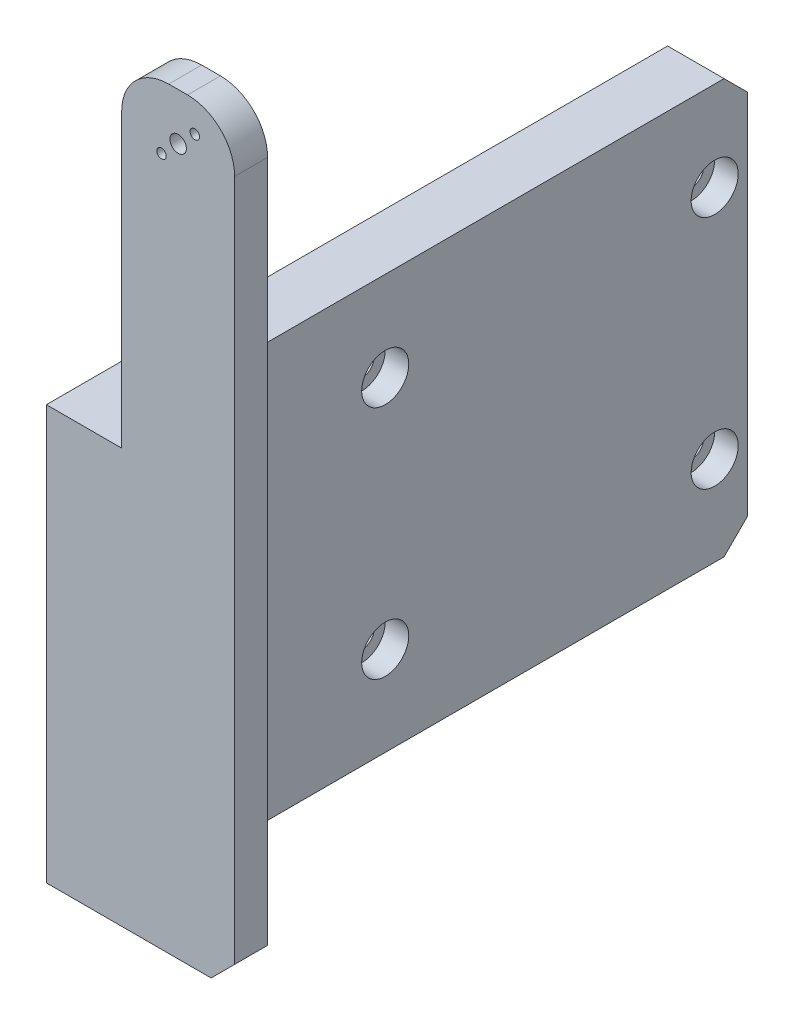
ISO-10303-21;
HEADER;
FILE_DESCRIPTION(('STEP AP214'),'2;1');
FILE_NAME('part.step','',(''),(''),'','','');
FILE_SCHEMA(('AUTOMOTIVE_DESIGN { 1 0 10303 214 1 1 1 1 }'));
ENDSEC;
DATA;
#1=APPLICATION_CONTEXT('core data for automotive mechanical design processes');
#2=APPLICATION_PROTOCOL_DEFINITION('international standard','automotive_design',2000,#1);
#3=PRODUCT_CONTEXT('',#1,'mechanical');
#4=PRODUCT('Part','Part','',(#3));
#5=PRODUCT_RELATED_PRODUCT_CATEGORY('part','',(#4));
#6=PRODUCT_DEFINITION_FORMATION('','',#4);
#7=PRODUCT_DEFINITION_CONTEXT('part definition',#1,'design');
#8=PRODUCT_DEFINITION('design','',#6,#7);
#9=PRODUCT_DEFINITION_SHAPE('','',#8);
#10=(LENGTH_UNIT() NAMED_UNIT(*) SI_UNIT(.MILLI.,.METRE.));
#11=(NAMED_UNIT(*) PLANE_ANGLE_UNIT() SI_UNIT($,.RADIAN.));
#12=(NAMED_UNIT(*) SI_UNIT($,.STERADIAN.) SOLID_ANGLE_UNIT());
#13=UNCERTAINTY_MEASURE_WITH_UNIT(LENGTH_MEASURE(1.E-05),#10,'distance_accuracy_value','');
#14=(GEOMETRIC_REPRESENTATION_CONTEXT(3) GLOBAL_UNCERTAINTY_ASSIGNED_CONTEXT((#13)) GLOBAL_UNIT_ASSIGNED_CONTEXT((#10,
#11,#12)) REPRESENTATION_CONTEXT('',''));
#15=CARTESIAN_POINT('',(0.,0.,0.));
#16=DIRECTION('',(0.,0.,1.));
#17=DIRECTION('',(1.,0.,0.));
#18=AXIS2_PLACEMENT_3D('',#15,#16,#17);
#19=CARTESIAN_POINT('',(2230.37555921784,777.962852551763,7.));
#20=DIRECTION('',(1.,0.,0.));
#21=DIRECTION('',(0.,1.,0.));
#22=AXIS2_PLACEMENT_3D('',#19,#20,#21);
#23=PLANE('',#22);
#24=DIRECTION('',(0.,-1.,0.));
#25=VECTOR('',#24,1.);
#26=CARTESIAN_POINT('',(2230.37555921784,777.962852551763,0.));
#27=LINE('',#26,#25);
#28=CARTESIAN_POINT('',(2230.37555921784,767.962852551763,0.));
#29=VERTEX_POINT('',#28);
#30=CARTESIAN_POINT('',(2230.37555921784,705.962852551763,0.));
#31=VERTEX_POINT('',#30);
#32=EDGE_CURVE('E141',#29,#31,#27,.T.);
#33=ORIENTED_EDGE('',*,*,#32,.T.);
#34=DIRECTION('',(0.,0.,-1.));
#35=VECTOR('',#34,1.);
#36=CARTESIAN_POINT('',(2230.37555921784,705.962852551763,7.));
#37=LINE('',#36,#35);
#38=CARTESIAN_POINT('',(2230.37555921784,705.962852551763,7.));
#39=VERTEX_POINT('',#38);
#40=EDGE_CURVE('E153',#39,#31,#37,.T.);
#41=ORIENTED_EDGE('',*,*,#40,.F.);
#42=DIRECTION('',(0.,-1.,0.));
#43=VECTOR('',#42,1.);
#44=CARTESIAN_POINT('',(2230.37555921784,777.962852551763,7.));
#45=LINE('',#44,#43);
#46=CARTESIAN_POINT('',(2230.37555921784,767.962852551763,7.));
#47=VERTEX_POINT('',#46);
#48=EDGE_CURVE('E176',#47,#39,#45,.T.);
#49=ORIENTED_EDGE('',*,*,#48,.F.);
#50=DIRECTION('',(0.,0.,-1.));
#51=VECTOR('',#50,1.);
#52=CARTESIAN_POINT('',(2230.37555921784,767.962852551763,7.));
#53=LINE('',#52,#51);
#54=EDGE_CURVE('E155',#47,#29,#53,.T.);
#55=ORIENTED_EDGE('',*,*,#54,.T.);
#56=EDGE_LOOP('',(#33,#41,#49,#55));
#57=FACE_BOUND('',#56,.T.);
#58=ADVANCED_FACE('F34',(#57),#23,.F.);
#59=CARTESIAN_POINT('',(2232.37555921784,617.962852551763,-6.00000000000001));
#60=DIRECTION('',(0.,1.,0.));
#61=DIRECTION('',(0.,0.,1.));
#62=AXIS2_PLACEMENT_3D('',#59,#60,#61);
#63=CYLINDRICAL_SURFACE('',#62,6.);
#64=CARTESIAN_POINT('',(2232.37555921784,705.962852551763,-6.00000000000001));
#65=DIRECTION('',(0.,-1.,0.));
#66=DIRECTION('',(1.,0.,0.));
#67=AXIS2_PLACEMENT_3D('',#64,#65,#66);
#68=CIRCLE('',#67,6.);
#69=CARTESIAN_POINT('',(2232.37555921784,705.962852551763,6.66133814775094E-13));
#70=VERTEX_POINT('',#69);
#71=CARTESIAN_POINT('',(2226.37555921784,705.962852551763,-6.00000000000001));
#72=VERTEX_POINT('',#71);
#73=EDGE_CURVE('E198',#70,#72,#68,.T.);
#74=ORIENTED_EDGE('',*,*,#73,.F.);
#75=DIRECTION('',(0.,-1.,0.));
#76=VECTOR('',#75,1.);
#77=CARTESIAN_POINT('',(2232.37555921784,705.962852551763,0.));
#78=LINE('',#77,#76);
#79=CARTESIAN_POINT('',(2232.37555921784,617.962852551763,0.));
#80=VERTEX_POINT('',#79);
#81=EDGE_CURVE('E145',#80,#70,#78,.F.);
#82=ORIENTED_EDGE('',*,*,#81,.F.);
#83=CARTESIAN_POINT('',(2232.37555921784,617.962852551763,-6.00000000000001));
#84=DIRECTION('',(0.,1.,0.));
#85=DIRECTION('',(0.,0.,1.));
#86=AXIS2_PLACEMENT_3D('',#83,#84,#85);
#87=CIRCLE('',#86,6.);
#88=CARTESIAN_POINT('',(2226.37555921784,617.962852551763,-6.00000000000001));
#89=VERTEX_POINT('',#88);
#90=EDGE_CURVE('E196',#89,#80,#87,.T.);
#91=ORIENTED_EDGE('',*,*,#90,.F.);
#92=DIRECTION('',(0.,-1.,0.));
#93=VECTOR('',#92,1.);
#94=CARTESIAN_POINT('',(2226.37555921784,617.962852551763,-6.00000000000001));
#95=LINE('',#94,#93);
#96=EDGE_CURVE('E186',#72,#89,#95,.T.);
#97=ORIENTED_EDGE('',*,*,#96,.F.);
#98=EDGE_LOOP('',(#74,#82,#91,#97));
#99=FACE_BOUND('',#98,.T.);
#100=ADVANCED_FACE('F343',(#99),#63,.F.);
#101=CARTESIAN_POINT('',(2240.37555921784,767.962852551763,7.));
#102=DIRECTION('',(0.,0.,-1.));
#103=DIRECTION('',(-1.,0.,0.));
#104=AXIS2_PLACEMENT_3D('',#101,#102,#103);
#105=CYLINDRICAL_SURFACE('',#104,10.);
#106=CARTESIAN_POINT('',(2240.37555921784,767.962852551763,0.));
#107=DIRECTION('',(0.,0.,1.));
#108=DIRECTION('',(1.,0.,0.));
#109=AXIS2_PLACEMENT_3D('',#106,#107,#108);
#110=CIRCLE('',#109,10.);
#111=CARTESIAN_POINT('',(2240.37555921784,777.962852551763,0.));
#112=VERTEX_POINT('',#111);
#113=EDGE_CURVE('E51',#29,#112,#110,.F.);
#114=ORIENTED_EDGE('',*,*,#113,.F.);
#115=ORIENTED_EDGE('',*,*,#54,.F.);
#116=CARTESIAN_POINT('',(2240.37555921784,767.962852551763,7.));
#117=DIRECTION('',(0.,0.,1.));
#118=DIRECTION('',(1.,0.,0.));
#119=AXIS2_PLACEMENT_3D('',#116,#117,#118);
#120=CIRCLE('',#119,10.);
#121=CARTESIAN_POINT('',(2240.37555921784,777.962852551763,7.));
#122=VERTEX_POINT('',#121);
#123=EDGE_CURVE('E224',#122,#47,#120,.T.);
#124=ORIENTED_EDGE('',*,*,#123,.F.);
#125=DIRECTION('',(0.,0.,-1.));
#126=VECTOR('',#125,1.);
#127=CARTESIAN_POINT('',(2240.37555921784,777.962852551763,7.));
#128=LINE('',#127,#126);
#129=EDGE_CURVE('E212',#112,#122,#128,.F.);
#130=ORIENTED_EDGE('',*,*,#129,.F.);
#131=EDGE_LOOP('',(#114,#115,#124,#130));
#132=FACE_BOUND('',#131,.T.);
#133=ADVANCED_FACE('F316',(#132),#105,.T.);
#134=CARTESIAN_POINT('',(2214.37555921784,636.962852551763,-123.));
#135=DIRECTION('',(1.,0.,0.));
#136=DIRECTION('',(0.,0.,-1.));
#137=AXIS2_PLACEMENT_3D('',#134,#135,#136);
#138=CYLINDRICAL_SURFACE('',#137,2.65);
#139=CARTESIAN_POINT('',(2214.37555921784,636.962852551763,-123.));
#140=DIRECTION('',(1.,0.,0.));
#141=DIRECTION('',(0.,0.,-1.));
#142=AXIS2_PLACEMENT_3D('',#139,#140,#141);
#143=CIRCLE('',#142,2.65);
#144=CARTESIAN_POINT('',(2214.37555921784,636.962852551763,-125.65));
#145=VERTEX_POINT('',#144);
#146=EDGE_CURVE('E280',#145,#145,#143,.T.);
#147=ORIENTED_EDGE('',*,*,#146,.F.);
#148=EDGE_LOOP('',(#147));
#149=FACE_BOUND('',#148,.T.);
#150=CARTESIAN_POINT('',(2221.37555921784,636.962852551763,-123.));
#151=DIRECTION('',(1.,0.,0.));
#152=DIRECTION('',(0.,0.,-1.));
#153=AXIS2_PLACEMENT_3D('',#150,#151,#152);
#154=CIRCLE('',#153,2.65);
#155=CARTESIAN_POINT('',(2221.37555921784,636.962852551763,-125.65));
#156=VERTEX_POINT('',#155);
#157=EDGE_CURVE('E38',#156,#156,#154,.F.);
#158=ORIENTED_EDGE('',*,*,#157,.F.);
#159=EDGE_LOOP('',(#158));
#160=FACE_BOUND('',#159,.T.);
#161=ADVANCED_FACE('F366',(#149,#160),#138,.F.);
#162=CARTESIAN_POINT('',(2214.37555921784,686.962852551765,-53.));
#163=DIRECTION('',(1.,0.,0.));
#164=DIRECTION('',(0.,0.,-1.));
#165=AXIS2_PLACEMENT_3D('',#162,#163,#164);
#166=CYLINDRICAL_SURFACE('',#165,2.65);
#167=CARTESIAN_POINT('',(2214.37555921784,686.962852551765,-53.));
#168=DIRECTION('',(1.,0.,0.));
#169=DIRECTION('',(0.,0.,-1.));
#170=AXIS2_PLACEMENT_3D('',#167,#168,#169);
#171=CIRCLE('',#170,2.65);
#172=CARTESIAN_POINT('',(2214.37555921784,686.962852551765,-55.65));
#173=VERTEX_POINT('',#172);
#174=EDGE_CURVE('E264',#173,#173,#171,.T.);
#175=ORIENTED_EDGE('',*,*,#174,.F.);
#176=EDGE_LOOP('',(#175));
#177=FACE_BOUND('',#176,.T.);
#178=CARTESIAN_POINT('',(2221.37555921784,686.962852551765,-53.));
#179=DIRECTION('',(1.,0.,0.));
#180=DIRECTION('',(0.,0.,-1.));
#181=AXIS2_PLACEMENT_3D('',#178,#179,#180);
#182=CIRCLE('',#181,2.65);
#183=CARTESIAN_POINT('',(2221.37555921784,686.962852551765,-55.65));
#184=VERTEX_POINT('',#183);
#185=EDGE_CURVE('E259',#184,#184,#182,.F.);
#186=ORIENTED_EDGE('',*,*,#185,.F.);
#187=EDGE_LOOP('',(#186));
#188=FACE_BOUND('',#187,.T.);
#189=ADVANCED_FACE('F435',(#177,#188),#166,.F.);
#190=CARTESIAN_POINT('',(2214.37555921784,636.962852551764,-52.9999999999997));
#191=DIRECTION('',(1.,0.,0.));
#192=DIRECTION('',(0.,0.,-1.));
#193=AXIS2_PLACEMENT_3D('',#190,#191,#192);
#194=CYLINDRICAL_SURFACE('',#193,2.65);
#195=CARTESIAN_POINT('',(2214.37555921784,636.962852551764,-52.9999999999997));
#196=DIRECTION('',(1.,0.,0.));
#197=DIRECTION('',(0.,0.,-1.));
#198=AXIS2_PLACEMENT_3D('',#195,#196,#197);
#199=CIRCLE('',#198,2.65);
#200=CARTESIAN_POINT('',(2214.37555921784,636.962852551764,-55.6499999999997));
#201=VERTEX_POINT('',#200);
#202=EDGE_CURVE('E268',#201,#201,#199,.T.);
#203=ORIENTED_EDGE('',*,*,#202,.F.);
#204=EDGE_LOOP('',(#203));
#205=FACE_BOUND('',#204,.T.);
#206=CARTESIAN_POINT('',(2221.37555921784,636.962852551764,-52.9999999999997));
#207=DIRECTION('',(1.,0.,0.));
#208=DIRECTION('',(0.,0.,-1.));
#209=AXIS2_PLACEMENT_3D('',#206,#207,#208);
#210=CIRCLE('',#209,2.65);
#211=CARTESIAN_POINT('',(2221.37555921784,636.962852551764,-55.6499999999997));
#212=VERTEX_POINT('',#211);
#213=EDGE_CURVE('E256',#212,#212,#210,.F.);
#214=ORIENTED_EDGE('',*,*,#213,.F.);
#215=EDGE_LOOP('',(#214));
#216=FACE_BOUND('',#215,.T.);
#217=ADVANCED_FACE('F427',(#205,#216),#194,.F.);
#218=CARTESIAN_POINT('',(2214.37555921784,686.962852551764,-123.));
#219=DIRECTION('',(1.,0.,0.));
#220=DIRECTION('',(0.,0.,-1.));
#221=AXIS2_PLACEMENT_3D('',#218,#219,#220);
#222=CYLINDRICAL_SURFACE('',#221,2.65000000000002);
#223=CARTESIAN_POINT('',(2214.37555921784,686.962852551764,-123.));
#224=DIRECTION('',(1.,0.,0.));
#225=DIRECTION('',(0.,0.,-1.));
#226=AXIS2_PLACEMENT_3D('',#223,#224,#225);
#227=CIRCLE('',#226,2.65000000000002);
#228=CARTESIAN_POINT('',(2214.37555921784,686.962852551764,-125.65));
#229=VERTEX_POINT('',#228);
#230=EDGE_CURVE('E273',#229,#229,#227,.T.);
#231=ORIENTED_EDGE('',*,*,#230,.F.);
#232=EDGE_LOOP('',(#231));
#233=FACE_BOUND('',#232,.T.);
#234=CARTESIAN_POINT('',(2221.37555921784,686.962852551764,-123.));
#235=DIRECTION('',(1.,0.,0.));
#236=DIRECTION('',(0.,0.,-1.));
#237=AXIS2_PLACEMENT_3D('',#234,#235,#236);
#238=CIRCLE('',#237,2.65000000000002);
#239=CARTESIAN_POINT('',(2221.37555921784,686.962852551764,-125.65));
#240=VERTEX_POINT('',#239);
#241=EDGE_CURVE('E253',#240,#240,#238,.F.);
#242=ORIENTED_EDGE('',*,*,#241,.F.);
#243=EDGE_LOOP('',(#242));
#244=FACE_BOUND('',#243,.T.);
#245=ADVANCED_FACE('F405',(#233,#244),#222,.F.);
#246=CARTESIAN_POINT('',(0.,0.,0.));
#247=DIRECTION('',(0.,0.,1.));
#248=DIRECTION('',(1.,0.,0.));
#249=AXIS2_PLACEMENT_3D('',#246,#247,#248);
#250=PLANE('',#249);
#251=CARTESIAN_POINT('',(2238.83720462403,764.424765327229,0.));
#252=DIRECTION('',(0.,0.,1.));
#253=DIRECTION('',(1.,0.,0.));
#254=AXIS2_PLACEMENT_3D('',#251,#252,#253);
#255=CIRCLE('',#254,1.5045700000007);
#256=CARTESIAN_POINT('',(2240.34177462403,764.424765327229,0.));
#257=VERTEX_POINT('',#256);
#258=EDGE_CURVE('E203',#257,#257,#255,.T.);
#259=ORIENTED_EDGE('',*,*,#258,.T.);
#260=EDGE_LOOP('',(#259));
#261=FACE_BOUND('',#260,.T.);
#262=CARTESIAN_POINT('',(2245.91391381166,771.500939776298,0.));
#263=DIRECTION('',(0.,0.,1.));
#264=DIRECTION('',(1.,0.,0.));
#265=AXIS2_PLACEMENT_3D('',#262,#263,#264);
#266=CIRCLE('',#265,1.50456999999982);
#267=CARTESIAN_POINT('',(2247.41848381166,771.500939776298,0.));
#268=VERTEX_POINT('',#267);
#269=EDGE_CURVE('E200',#268,#268,#266,.T.);
#270=ORIENTED_EDGE('',*,*,#269,.T.);
#271=EDGE_LOOP('',(#270));
#272=FACE_BOUND('',#271,.T.);
#273=CARTESIAN_POINT('',(2242.37555921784,767.962852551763,0.));
#274=DIRECTION('',(0.,0.,1.));
#275=DIRECTION('',(1.,0.,0.));
#276=AXIS2_PLACEMENT_3D('',#273,#274,#275);
#277=CIRCLE('',#276,1.75000000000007);
#278=CARTESIAN_POINT('',(2244.12555921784,767.962852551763,0.));
#279=VERTEX_POINT('',#278);
#280=EDGE_CURVE('E293',#279,#279,#277,.T.);
#281=ORIENTED_EDGE('',*,*,#280,.T.);
#282=EDGE_LOOP('',(#281));
#283=FACE_BOUND('',#282,.T.);
#284=DIRECTION('',(0.,1.,0.));
#285=VECTOR('',#284,1.);
#286=CARTESIAN_POINT('',(2254.37555921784,777.962852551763,0.));
#287=LINE('',#286,#285);
#288=CARTESIAN_POINT('',(2254.37555921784,622.962852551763,0.));
#289=VERTEX_POINT('',#288);
#290=CARTESIAN_POINT('',(2254.37555921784,767.962852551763,0.));
#291=VERTEX_POINT('',#290);
#292=EDGE_CURVE('E189',#289,#291,#287,.T.);
#293=ORIENTED_EDGE('',*,*,#292,.F.);
#294=DIRECTION('',(0.707106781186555,0.70710678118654,0.));
#295=VECTOR('',#294,1.);
#296=CARTESIAN_POINT('',(2254.37555921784,622.962852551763,0.));
#297=LINE('',#296,#295);
#298=CARTESIAN_POINT('',(2249.37555921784,617.962852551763,0.));
#299=VERTEX_POINT('',#298);
#300=EDGE_CURVE('E43',#289,#299,#297,.F.);
#301=ORIENTED_EDGE('',*,*,#300,.T.);
#302=DIRECTION('',(1.,0.,0.));
#303=VECTOR('',#302,1.);
#304=CARTESIAN_POINT('',(2230.37555921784,617.962852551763,0.));
#305=LINE('',#304,#303);
#306=EDGE_CURVE('E175',#80,#299,#305,.T.);
#307=ORIENTED_EDGE('',*,*,#306,.F.);
#308=ORIENTED_EDGE('',*,*,#81,.T.);
#309=DIRECTION('',(1.,0.,3.32944442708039E-13));
#310=VECTOR('',#309,1.);
#311=CARTESIAN_POINT('',(2232.37555921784,705.962852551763,6.66133814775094E-13));
#312=LINE('',#311,#310);
#313=EDGE_CURVE('E137',#31,#70,#312,.T.);
#314=ORIENTED_EDGE('',*,*,#313,.F.);
#315=ORIENTED_EDGE('',*,*,#32,.F.);
#316=ORIENTED_EDGE('',*,*,#113,.T.);
#317=DIRECTION('',(-1.,0.,0.));
#318=VECTOR('',#317,1.);
#319=CARTESIAN_POINT('',(2230.37555921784,777.962852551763,0.));
#320=LINE('',#319,#318);
#321=CARTESIAN_POINT('',(2244.37555921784,777.962852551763,0.));
#322=VERTEX_POINT('',#321);
#323=EDGE_CURVE('E179',#322,#112,#320,.T.);
#324=ORIENTED_EDGE('',*,*,#323,.F.);
#325=CARTESIAN_POINT('',(2244.37555921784,767.962852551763,0.));
#326=DIRECTION('',(0.,0.,1.));
#327=DIRECTION('',(1.,0.,0.));
#328=AXIS2_PLACEMENT_3D('',#325,#326,#327);
#329=CIRCLE('',#328,10.);
#330=EDGE_CURVE('E218',#322,#291,#329,.F.);
#331=ORIENTED_EDGE('',*,*,#330,.T.);
#332=EDGE_LOOP('',(#293,#301,#307,#308,#314,#315,#316,#324,#331));
#333=FACE_BOUND('',#332,.T.);
#334=ADVANCED_FACE('F140',(#261,#272,#283,#333),#250,.F.);
#335=CARTESIAN_POINT('',(2230.37555921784,617.962852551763,7.));
#336=DIRECTION('',(0.,1.,0.));
#337=DIRECTION('',(0.,0.,1.));
#338=AXIS2_PLACEMENT_3D('',#335,#336,#337);
#339=PLANE('',#338);
#340=DIRECTION('',(0.,0.,1.));
#341=VECTOR('',#340,1.);
#342=CARTESIAN_POINT('',(2214.37555921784,617.962852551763,7.));
#343=LINE('',#342,#341);
#344=CARTESIAN_POINT('',(2214.37555921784,617.962852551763,-125.));
#345=VERTEX_POINT('',#344);
#346=CARTESIAN_POINT('',(2214.37555921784,617.962852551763,7.));
#347=VERTEX_POINT('',#346);
#348=EDGE_CURVE('E172',#345,#347,#343,.T.);
#349=ORIENTED_EDGE('',*,*,#348,.F.);
#350=DIRECTION('',(1.,0.,0.));
#351=VECTOR('',#350,1.);
#352=CARTESIAN_POINT('',(2226.37555921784,617.962852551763,-125.));
#353=LINE('',#352,#351);
#354=CARTESIAN_POINT('',(2226.37555921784,617.962852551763,-125.));
#355=VERTEX_POINT('',#354);
#356=EDGE_CURVE('E247',#345,#355,#353,.T.);
#357=ORIENTED_EDGE('',*,*,#356,.T.);
#358=DIRECTION('',(0.,0.,1.));
#359=VECTOR('',#358,1.);
#360=CARTESIAN_POINT('',(2226.37555921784,617.962852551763,-130.));
#361=LINE('',#360,#359);
#362=EDGE_CURVE('E168',#355,#89,#361,.T.);
#363=ORIENTED_EDGE('',*,*,#362,.T.);
#364=ORIENTED_EDGE('',*,*,#90,.T.);
#365=ORIENTED_EDGE('',*,*,#306,.T.);
#366=DIRECTION('',(0.,0.,1.));
#367=VECTOR('',#366,1.);
#368=CARTESIAN_POINT('',(2249.37555921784,617.962852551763,7.));
#369=LINE('',#368,#367);
#370=CARTESIAN_POINT('',(2249.37555921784,617.962852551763,7.));
#371=VERTEX_POINT('',#370);
#372=EDGE_CURVE('E245',#299,#371,#369,.T.);
#373=ORIENTED_EDGE('',*,*,#372,.T.);
#374=DIRECTION('',(1.,0.,0.));
#375=VECTOR('',#374,1.);
#376=CARTESIAN_POINT('',(2230.37555921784,617.962852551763,7.));
#377=LINE('',#376,#375);
#378=EDGE_CURVE('E178',#347,#371,#377,.T.);
#379=ORIENTED_EDGE('',*,*,#378,.F.);
#380=EDGE_LOOP('',(#349,#357,#363,#364,#365,#373,#379));
#381=FACE_BOUND('',#380,.T.);
#382=ADVANCED_FACE('F312',(#381),#339,.F.);
#383=CARTESIAN_POINT('',(2254.37555921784,777.962852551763,7.));
#384=DIRECTION('',(-1.,0.,0.));
#385=DIRECTION('',(0.,-1.,0.));
#386=AXIS2_PLACEMENT_3D('',#383,#384,#385);
#387=PLANE('',#386);
#388=DIRECTION('',(0.,1.,0.));
#389=VECTOR('',#388,1.);
#390=CARTESIAN_POINT('',(2254.37555921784,777.962852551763,7.));
#391=LINE('',#390,#389);
#392=CARTESIAN_POINT('',(2254.37555921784,622.962852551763,7.));
#393=VERTEX_POINT('',#392);
#394=CARTESIAN_POINT('',(2254.37555921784,767.962852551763,7.));
#395=VERTEX_POINT('',#394);
#396=EDGE_CURVE('E181',#393,#395,#391,.T.);
#397=ORIENTED_EDGE('',*,*,#396,.F.);
#398=DIRECTION('',(0.,0.,-1.));
#399=VECTOR('',#398,1.);
#400=CARTESIAN_POINT('',(2254.37555921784,622.962852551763,7.));
#401=LINE('',#400,#399);
#402=EDGE_CURVE('E249',#393,#289,#401,.T.);
#403=ORIENTED_EDGE('',*,*,#402,.T.);
#404=ORIENTED_EDGE('',*,*,#292,.T.);
#405=DIRECTION('',(0.,0.,-1.));
#406=VECTOR('',#405,1.);
#407=CARTESIAN_POINT('',(2254.37555921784,767.962852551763,7.));
#408=LINE('',#407,#406);
#409=EDGE_CURVE('E221',#291,#395,#408,.F.);
#410=ORIENTED_EDGE('',*,*,#409,.T.);
#411=EDGE_LOOP('',(#397,#403,#404,#410));
#412=FACE_BOUND('',#411,.T.);
#413=ADVANCED_FACE('F327',(#412),#387,.F.);
#414=CARTESIAN_POINT('',(2230.37555921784,777.962852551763,7.));
#415=DIRECTION('',(0.,-1.,0.));
#416=DIRECTION('',(0.,0.,-1.));
#417=AXIS2_PLACEMENT_3D('',#414,#415,#416);
#418=PLANE('',#417);
#419=DIRECTION('',(-1.,0.,0.));
#420=VECTOR('',#419,1.);
#421=CARTESIAN_POINT('',(2230.37555921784,777.962852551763,7.));
#422=LINE('',#421,#420);
#423=CARTESIAN_POINT('',(2244.37555921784,777.962852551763,7.));
#424=VERTEX_POINT('',#423);
#425=EDGE_CURVE('E183',#424,#122,#422,.T.);
#426=ORIENTED_EDGE('',*,*,#425,.F.);
#427=DIRECTION('',(0.,0.,-1.));
#428=VECTOR('',#427,1.);
#429=CARTESIAN_POINT('',(2244.37555921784,777.962852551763,7.));
#430=LINE('',#429,#428);
#431=EDGE_CURVE('E214',#424,#322,#430,.T.);
#432=ORIENTED_EDGE('',*,*,#431,.T.);
#433=ORIENTED_EDGE('',*,*,#323,.T.);
#434=ORIENTED_EDGE('',*,*,#129,.T.);
#435=EDGE_LOOP('',(#426,#432,#433,#434));
#436=FACE_BOUND('',#435,.T.);
#437=ADVANCED_FACE('F319',(#436),#418,.F.);
#438=CARTESIAN_POINT('',(0.,0.,7.));
#439=DIRECTION('',(0.,0.,1.));
#440=DIRECTION('',(1.,0.,0.));
#441=AXIS2_PLACEMENT_3D('',#438,#439,#440);
#442=PLANE('',#441);
#443=CARTESIAN_POINT('',(2245.91391381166,771.500939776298,7.));
#444=DIRECTION('',(0.,0.,1.));
#445=DIRECTION('',(1.,0.,0.));
#446=AXIS2_PLACEMENT_3D('',#443,#444,#445);
#447=CIRCLE('',#446,1.00457000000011);
#448=CARTESIAN_POINT('',(2246.91848381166,771.500939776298,7.));
#449=VERTEX_POINT('',#448);
#450=EDGE_CURVE('E285',#449,#449,#447,.T.);
#451=ORIENTED_EDGE('',*,*,#450,.F.);
#452=EDGE_LOOP('',(#451));
#453=FACE_BOUND('',#452,.T.);
#454=CARTESIAN_POINT('',(2238.83720462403,764.424765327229,7.));
#455=DIRECTION('',(0.,0.,1.));
#456=DIRECTION('',(1.,0.,0.));
#457=AXIS2_PLACEMENT_3D('',#454,#455,#456);
#458=CIRCLE('',#457,1.00457000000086);
#459=CARTESIAN_POINT('',(2239.84177462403,764.424765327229,7.));
#460=VERTEX_POINT('',#459);
#461=EDGE_CURVE('E284',#460,#460,#458,.T.);
#462=ORIENTED_EDGE('',*,*,#461,.F.);
#463=EDGE_LOOP('',(#462));
#464=FACE_BOUND('',#463,.T.);
#465=CARTESIAN_POINT('',(2242.37555921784,767.962852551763,7.));
#466=DIRECTION('',(0.,0.,1.));
#467=DIRECTION('',(1.,0.,0.));
#468=AXIS2_PLACEMENT_3D('',#465,#466,#467);
#469=CIRCLE('',#468,1.75000000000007);
#470=CARTESIAN_POINT('',(2244.12555921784,767.962852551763,7.));
#471=VERTEX_POINT('',#470);
#472=EDGE_CURVE('E288',#471,#471,#469,.T.);
#473=ORIENTED_EDGE('',*,*,#472,.F.);
#474=EDGE_LOOP('',(#473));
#475=FACE_BOUND('',#474,.T.);
#476=ORIENTED_EDGE('',*,*,#378,.T.);
#477=DIRECTION('',(-0.707106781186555,-0.70710678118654,0.));
#478=VECTOR('',#477,1.);
#479=CARTESIAN_POINT('',(815.706353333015,-815.706353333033,7.));
#480=LINE('',#479,#478);
#481=EDGE_CURVE('E11',#371,#393,#480,.F.);
#482=ORIENTED_EDGE('',*,*,#481,.T.);
#483=ORIENTED_EDGE('',*,*,#396,.T.);
#484=CARTESIAN_POINT('',(2244.37555921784,767.962852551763,7.));
#485=DIRECTION('',(0.,0.,1.));
#486=DIRECTION('',(1.,0.,0.));
#487=AXIS2_PLACEMENT_3D('',#484,#485,#486);
#488=CIRCLE('',#487,10.);
#489=EDGE_CURVE('E226',#395,#424,#488,.T.);
#490=ORIENTED_EDGE('',*,*,#489,.T.);
#491=ORIENTED_EDGE('',*,*,#425,.T.);
#492=ORIENTED_EDGE('',*,*,#123,.T.);
#493=ORIENTED_EDGE('',*,*,#48,.T.);
#494=DIRECTION('',(1.,0.,0.));
#495=VECTOR('',#494,1.);
#496=CARTESIAN_POINT('',(2214.37555921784,705.962852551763,7.));
#497=LINE('',#496,#495);
#498=CARTESIAN_POINT('',(2214.37555921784,705.962852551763,7.));
#499=VERTEX_POINT('',#498);
#500=EDGE_CURVE('E161',#499,#39,#497,.T.);
#501=ORIENTED_EDGE('',*,*,#500,.F.);
#502=DIRECTION('',(0.,1.,0.));
#503=VECTOR('',#502,1.);
#504=CARTESIAN_POINT('',(2214.37555921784,617.962852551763,7.));
#505=LINE('',#504,#503);
#506=EDGE_CURVE('E162',#347,#499,#505,.T.);
#507=ORIENTED_EDGE('',*,*,#506,.F.);
#508=EDGE_LOOP('',(#476,#482,#483,#490,#491,#492,#493,#501,#507));
#509=FACE_BOUND('',#508,.T.);
#510=ADVANCED_FACE('F314',(#453,#464,#475,#509),#442,.T.);
#511=CARTESIAN_POINT('',(2214.37555921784,705.962852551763,7.));
#512=DIRECTION('',(0.,-1.,0.));
#513=DIRECTION('',(1.,0.,0.));
#514=AXIS2_PLACEMENT_3D('',#511,#512,#513);
#515=PLANE('',#514);
#516=DIRECTION('',(0.,0.,1.));
#517=VECTOR('',#516,1.);
#518=CARTESIAN_POINT('',(2226.37555921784,705.962852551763,-130.));
#519=LINE('',#518,#517);
#520=CARTESIAN_POINT('',(2226.37555921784,705.962852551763,-125.));
#521=VERTEX_POINT('',#520);
#522=EDGE_CURVE('E163',#521,#72,#519,.T.);
#523=ORIENTED_EDGE('',*,*,#522,.F.);
#524=DIRECTION('',(-1.,0.,0.));
#525=VECTOR('',#524,1.);
#526=CARTESIAN_POINT('',(2214.37555921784,705.962852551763,-125.));
#527=LINE('',#526,#525);
#528=CARTESIAN_POINT('',(2214.37555921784,705.962852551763,-125.));
#529=VERTEX_POINT('',#528);
#530=EDGE_CURVE('E239',#521,#529,#527,.T.);
#531=ORIENTED_EDGE('',*,*,#530,.T.);
#532=DIRECTION('',(0.,0.,-1.));
#533=VECTOR('',#532,1.);
#534=CARTESIAN_POINT('',(2214.37555921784,705.962852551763,7.));
#535=LINE('',#534,#533);
#536=EDGE_CURVE('E166',#499,#529,#535,.T.);
#537=ORIENTED_EDGE('',*,*,#536,.F.);
#538=ORIENTED_EDGE('',*,*,#500,.T.);
#539=ORIENTED_EDGE('',*,*,#40,.T.);
#540=ORIENTED_EDGE('',*,*,#313,.T.);
#541=ORIENTED_EDGE('',*,*,#73,.T.);
#542=EDGE_LOOP('',(#523,#531,#537,#538,#539,#540,#541));
#543=FACE_BOUND('',#542,.T.);
#544=ADVANCED_FACE('F159',(#543),#515,.F.);
#545=CARTESIAN_POINT('',(2214.37555921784,0.,0.));
#546=DIRECTION('',(-1.,0.,0.));
#547=DIRECTION('',(0.,0.,1.));
#548=AXIS2_PLACEMENT_3D('',#545,#546,#547);
#549=PLANE('',#548);
#550=ORIENTED_EDGE('',*,*,#230,.T.);
#551=EDGE_LOOP('',(#550));
#552=FACE_BOUND('',#551,.T.);
#553=ORIENTED_EDGE('',*,*,#202,.T.);
#554=EDGE_LOOP('',(#553));
#555=FACE_BOUND('',#554,.T.);
#556=ORIENTED_EDGE('',*,*,#174,.T.);
#557=EDGE_LOOP('',(#556));
#558=FACE_BOUND('',#557,.T.);
#559=ORIENTED_EDGE('',*,*,#146,.T.);
#560=EDGE_LOOP('',(#559));
#561=FACE_BOUND('',#560,.T.);
#562=ORIENTED_EDGE('',*,*,#536,.T.);
#563=DIRECTION('',(0.,-0.707106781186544,-0.707106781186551));
#564=VECTOR('',#563,1.);
#565=CARTESIAN_POINT('',(2214.37555921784,415.481426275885,-415.481426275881));
#566=LINE('',#565,#564);
#567=CARTESIAN_POINT('',(2214.37555921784,700.962852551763,-130.));
#568=VERTEX_POINT('',#567);
#569=EDGE_CURVE('E243',#529,#568,#566,.T.);
#570=ORIENTED_EDGE('',*,*,#569,.T.);
#571=DIRECTION('',(0.,1.,0.));
#572=VECTOR('',#571,1.);
#573=CARTESIAN_POINT('',(2214.37555921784,617.962852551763,-130.));
#574=LINE('',#573,#572);
#575=CARTESIAN_POINT('',(2214.37555921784,622.962852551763,-130.));
#576=VERTEX_POINT('',#575);
#577=EDGE_CURVE('E296',#576,#568,#574,.T.);
#578=ORIENTED_EDGE('',*,*,#577,.F.);
#579=DIRECTION('',(0.,-0.707106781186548,0.707106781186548));
#580=VECTOR('',#579,1.);
#581=CARTESIAN_POINT('',(2214.37555921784,246.481426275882,246.481426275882));
#582=LINE('',#581,#580);
#583=EDGE_CURVE('E241',#576,#345,#582,.T.);
#584=ORIENTED_EDGE('',*,*,#583,.T.);
#585=ORIENTED_EDGE('',*,*,#348,.T.);
#586=ORIENTED_EDGE('',*,*,#506,.T.);
#587=EDGE_LOOP('',(#562,#570,#578,#584,#585,#586));
#588=FACE_BOUND('',#587,.T.);
#589=ADVANCED_FACE('F307',(#552,#555,#558,#561,#588),#549,.T.);
#590=CARTESIAN_POINT('',(2226.37555921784,617.962852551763,-130.));
#591=DIRECTION('',(-1.,0.,0.));
#592=DIRECTION('',(0.,0.,1.));
#593=AXIS2_PLACEMENT_3D('',#590,#591,#592);
#594=PLANE('',#593);
#595=CARTESIAN_POINT('',(2226.37555921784,686.962852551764,-123.));
#596=DIRECTION('',(1.,0.,0.));
#597=DIRECTION('',(0.,0.,-1.));
#598=AXIS2_PLACEMENT_3D('',#595,#596,#597);
#599=CIRCLE('',#598,5.00000000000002);
#600=CARTESIAN_POINT('',(2226.37555921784,686.962852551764,-128.));
#601=VERTEX_POINT('',#600);
#602=EDGE_CURVE('E696',#601,#601,#599,.T.);
#603=ORIENTED_EDGE('',*,*,#602,.F.);
#604=EDGE_LOOP('',(#603));
#605=FACE_BOUND('',#604,.T.);
#606=CARTESIAN_POINT('',(2226.37555921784,636.962852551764,-52.9999999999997));
#607=DIRECTION('',(1.,0.,0.));
#608=DIRECTION('',(0.,0.,-1.));
#609=AXIS2_PLACEMENT_3D('',#606,#607,#608);
#610=CIRCLE('',#609,5.);
#611=CARTESIAN_POINT('',(2226.37555921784,636.962852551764,-57.9999999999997));
#612=VERTEX_POINT('',#611);
#613=EDGE_CURVE('E701',#612,#612,#610,.T.);
#614=ORIENTED_EDGE('',*,*,#613,.F.);
#615=EDGE_LOOP('',(#614));
#616=FACE_BOUND('',#615,.T.);
#617=CARTESIAN_POINT('',(2226.37555921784,636.962852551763,-123.));
#618=DIRECTION('',(1.,0.,0.));
#619=DIRECTION('',(0.,0.,-1.));
#620=AXIS2_PLACEMENT_3D('',#617,#618,#619);
#621=CIRCLE('',#620,5.00000000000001);
#622=CARTESIAN_POINT('',(2226.37555921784,636.962852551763,-128.));
#623=VERTEX_POINT('',#622);
#624=EDGE_CURVE('E156',#623,#623,#621,.T.);
#625=ORIENTED_EDGE('',*,*,#624,.F.);
#626=EDGE_LOOP('',(#625));
#627=FACE_BOUND('',#626,.T.);
#628=CARTESIAN_POINT('',(2226.37555921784,686.962852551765,-53.));
#629=DIRECTION('',(1.,0.,0.));
#630=DIRECTION('',(0.,0.,-1.));
#631=AXIS2_PLACEMENT_3D('',#628,#629,#630);
#632=CIRCLE('',#631,5.);
#633=CARTESIAN_POINT('',(2226.37555921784,686.962852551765,-58.));
#634=VERTEX_POINT('',#633);
#635=EDGE_CURVE('E277',#634,#634,#632,.T.);
#636=ORIENTED_EDGE('',*,*,#635,.F.);
#637=EDGE_LOOP('',(#636));
#638=FACE_BOUND('',#637,.T.);
#639=DIRECTION('',(0.,-1.,0.));
#640=VECTOR('',#639,1.);
#641=CARTESIAN_POINT('',(2226.37555921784,617.962852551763,-130.));
#642=LINE('',#641,#640);
#643=CARTESIAN_POINT('',(2226.37555921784,700.962852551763,-130.));
#644=VERTEX_POINT('',#643);
#645=CARTESIAN_POINT('',(2226.37555921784,622.962852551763,-130.));
#646=VERTEX_POINT('',#645);
#647=EDGE_CURVE('E299',#644,#646,#642,.T.);
#648=ORIENTED_EDGE('',*,*,#647,.F.);
#649=DIRECTION('',(0.,0.707106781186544,0.707106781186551));
#650=VECTOR('',#649,1.);
#651=CARTESIAN_POINT('',(2226.37555921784,700.962852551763,-130.));
#652=LINE('',#651,#650);
#653=EDGE_CURVE('E237',#644,#521,#652,.T.);
#654=ORIENTED_EDGE('',*,*,#653,.T.);
#655=ORIENTED_EDGE('',*,*,#522,.T.);
#656=ORIENTED_EDGE('',*,*,#96,.T.);
#657=ORIENTED_EDGE('',*,*,#362,.F.);
#658=DIRECTION('',(0.,0.707106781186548,-0.707106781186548));
#659=VECTOR('',#658,1.);
#660=CARTESIAN_POINT('',(2226.37555921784,622.962852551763,-130.));
#661=LINE('',#660,#659);
#662=EDGE_CURVE('E235',#355,#646,#661,.T.);
#663=ORIENTED_EDGE('',*,*,#662,.T.);
#664=EDGE_LOOP('',(#648,#654,#655,#656,#657,#663));
#665=FACE_BOUND('',#664,.T.);
#666=ADVANCED_FACE('F381',(#605,#616,#627,#638,#665),#594,.F.);
#667=CARTESIAN_POINT('',(0.,0.,-130.));
#668=DIRECTION('',(0.,0.,-1.));
#669=DIRECTION('',(-1.,0.,0.));
#670=AXIS2_PLACEMENT_3D('',#667,#668,#669);
#671=PLANE('',#670);
#672=ORIENTED_EDGE('',*,*,#577,.T.);
#673=DIRECTION('',(1.,0.,0.));
#674=VECTOR('',#673,1.);
#675=CARTESIAN_POINT('',(2226.37555921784,700.962852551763,-130.));
#676=LINE('',#675,#674);
#677=EDGE_CURVE('E232',#568,#644,#676,.T.);
#678=ORIENTED_EDGE('',*,*,#677,.T.);
#679=ORIENTED_EDGE('',*,*,#647,.T.);
#680=DIRECTION('',(-1.,0.,0.));
#681=VECTOR('',#680,1.);
#682=CARTESIAN_POINT('',(2214.37555921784,622.962852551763,-130.));
#683=LINE('',#682,#681);
#684=EDGE_CURVE('E229',#646,#576,#683,.T.);
#685=ORIENTED_EDGE('',*,*,#684,.T.);
#686=EDGE_LOOP('',(#672,#678,#679,#685));
#687=FACE_BOUND('',#686,.T.);
#688=ADVANCED_FACE('F374',(#687),#671,.T.);
#689=CARTESIAN_POINT('',(2242.37555921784,767.962852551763,-3.));
#690=DIRECTION('',(0.,0.,1.));
#691=DIRECTION('',(1.,0.,0.));
#692=AXIS2_PLACEMENT_3D('',#689,#690,#691);
#693=CYLINDRICAL_SURFACE('',#692,1.75000000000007);
#694=ORIENTED_EDGE('',*,*,#472,.T.);
#695=EDGE_LOOP('',(#694));
#696=FACE_BOUND('',#695,.T.);
#697=ORIENTED_EDGE('',*,*,#280,.F.);
#698=EDGE_LOOP('',(#697));
#699=FACE_BOUND('',#698,.T.);
#700=ADVANCED_FACE('F390',(#696,#699),#693,.F.);
#701=CARTESIAN_POINT('',(2238.83720462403,764.424765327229,-3.));
#702=DIRECTION('',(0.,0.,1.));
#703=DIRECTION('',(1.,0.,0.));
#704=AXIS2_PLACEMENT_3D('',#701,#702,#703);
#705=CYLINDRICAL_SURFACE('',#704,1.00457000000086);
#706=CARTESIAN_POINT('',(2238.83720462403,764.424765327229,0.499999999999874));
#707=DIRECTION('',(0.,0.,1.));
#708=DIRECTION('',(1.,0.,0.));
#709=AXIS2_PLACEMENT_3D('',#706,#707,#708);
#710=CIRCLE('',#709,1.00457000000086);
#711=CARTESIAN_POINT('',(2239.84177462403,764.424765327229,0.499999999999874));
#712=VERTEX_POINT('',#711);
#713=EDGE_CURVE('E206',#712,#712,#710,.F.);
#714=ORIENTED_EDGE('',*,*,#713,.T.);
#715=EDGE_LOOP('',(#714));
#716=FACE_BOUND('',#715,.T.);
#717=ORIENTED_EDGE('',*,*,#461,.T.);
#718=EDGE_LOOP('',(#717));
#719=FACE_BOUND('',#718,.T.);
#720=ADVANCED_FACE('F563',(#716,#719),#705,.F.);
#721=CARTESIAN_POINT('',(2245.91391381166,771.500939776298,-3.));
#722=DIRECTION('',(0.,0.,1.));
#723=DIRECTION('',(1.,0.,0.));
#724=AXIS2_PLACEMENT_3D('',#721,#722,#723);
#725=CYLINDRICAL_SURFACE('',#724,1.00457000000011);
#726=CARTESIAN_POINT('',(2245.91391381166,771.500939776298,0.499999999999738));
#727=DIRECTION('',(0.,0.,1.));
#728=DIRECTION('',(1.,0.,0.));
#729=AXIS2_PLACEMENT_3D('',#726,#727,#728);
#730=CIRCLE('',#729,1.00457000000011);
#731=CARTESIAN_POINT('',(2246.91848381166,771.500939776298,0.499999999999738));
#732=VERTEX_POINT('',#731);
#733=EDGE_CURVE('E209',#732,#732,#730,.F.);
#734=ORIENTED_EDGE('',*,*,#733,.T.);
#735=EDGE_LOOP('',(#734));
#736=FACE_BOUND('',#735,.T.);
#737=ORIENTED_EDGE('',*,*,#450,.T.);
#738=EDGE_LOOP('',(#737));
#739=FACE_BOUND('',#738,.T.);
#740=ADVANCED_FACE('F357',(#736,#739),#725,.F.);
#741=CARTESIAN_POINT('',(2238.83720462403,764.424765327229,0.));
#742=DIRECTION('',(0.,0.,-1.));
#743=DIRECTION('',(-1.,0.,0.));
#744=AXIS2_PLACEMENT_3D('',#741,#742,#743);
#745=CONICAL_SURFACE('',#744,1.5045700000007,0.785398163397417);
#746=ORIENTED_EDGE('',*,*,#713,.F.);
#747=EDGE_LOOP('',(#746));
#748=FACE_BOUND('',#747,.T.);
#749=ORIENTED_EDGE('',*,*,#258,.F.);
#750=EDGE_LOOP('',(#749));
#751=FACE_BOUND('',#750,.T.);
#752=ADVANCED_FACE('F353',(#748,#751),#745,.F.);
#753=CARTESIAN_POINT('',(2245.91391381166,771.500939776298,0.));
#754=DIRECTION('',(0.,0.,-1.));
#755=DIRECTION('',(-1.,0.,0.));
#756=AXIS2_PLACEMENT_3D('',#753,#754,#755);
#757=CONICAL_SURFACE('',#756,1.50456999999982,0.785398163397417);
#758=ORIENTED_EDGE('',*,*,#733,.F.);
#759=EDGE_LOOP('',(#758));
#760=FACE_BOUND('',#759,.T.);
#761=ORIENTED_EDGE('',*,*,#269,.F.);
#762=EDGE_LOOP('',(#761));
#763=FACE_BOUND('',#762,.T.);
#764=ADVANCED_FACE('F356',(#760,#763),#757,.F.);
#765=CARTESIAN_POINT('',(2244.37555921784,767.962852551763,7.));
#766=DIRECTION('',(0.,0.,-1.));
#767=DIRECTION('',(-1.,0.,0.));
#768=AXIS2_PLACEMENT_3D('',#765,#766,#767);
#769=CYLINDRICAL_SURFACE('',#768,10.);
#770=ORIENTED_EDGE('',*,*,#489,.F.);
#771=ORIENTED_EDGE('',*,*,#409,.F.);
#772=ORIENTED_EDGE('',*,*,#330,.F.);
#773=ORIENTED_EDGE('',*,*,#431,.F.);
#774=EDGE_LOOP('',(#770,#771,#772,#773));
#775=FACE_BOUND('',#774,.T.);
#776=ADVANCED_FACE('F325',(#775),#769,.T.);
#777=CARTESIAN_POINT('',(0.,700.962852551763,-130.));
#778=DIRECTION('',(0.,0.707106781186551,-0.707106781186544));
#779=DIRECTION('',(-1.,0.,0.));
#780=AXIS2_PLACEMENT_3D('',#777,#778,#779);
#781=PLANE('',#780);
#782=ORIENTED_EDGE('',*,*,#569,.F.);
#783=ORIENTED_EDGE('',*,*,#530,.F.);
#784=ORIENTED_EDGE('',*,*,#653,.F.);
#785=ORIENTED_EDGE('',*,*,#677,.F.);
#786=EDGE_LOOP('',(#782,#783,#784,#785));
#787=FACE_BOUND('',#786,.T.);
#788=ADVANCED_FACE('F340',(#787),#781,.T.);
#789=CARTESIAN_POINT('',(0.,622.962852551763,-130.));
#790=DIRECTION('',(0.,-0.707106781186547,-0.707106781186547));
#791=DIRECTION('',(1.,0.,0.));
#792=AXIS2_PLACEMENT_3D('',#789,#790,#791);
#793=PLANE('',#792);
#794=ORIENTED_EDGE('',*,*,#662,.F.);
#795=ORIENTED_EDGE('',*,*,#356,.F.);
#796=ORIENTED_EDGE('',*,*,#583,.F.);
#797=ORIENTED_EDGE('',*,*,#684,.F.);
#798=EDGE_LOOP('',(#794,#795,#796,#797));
#799=FACE_BOUND('',#798,.T.);
#800=ADVANCED_FACE('F332',(#799),#793,.T.);
#801=CARTESIAN_POINT('',(2254.37555921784,622.962852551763,7.));
#802=DIRECTION('',(-0.70710678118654,0.707106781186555,0.));
#803=DIRECTION('',(0.,0.,-1.));
#804=AXIS2_PLACEMENT_3D('',#801,#802,#803);
#805=PLANE('',#804);
#806=ORIENTED_EDGE('',*,*,#481,.F.);
#807=ORIENTED_EDGE('',*,*,#372,.F.);
#808=ORIENTED_EDGE('',*,*,#300,.F.);
#809=ORIENTED_EDGE('',*,*,#402,.F.);
#810=EDGE_LOOP('',(#806,#807,#808,#809));
#811=FACE_BOUND('',#810,.T.);
#812=ADVANCED_FACE('F36',(#811),#805,.F.);
#813=CARTESIAN_POINT('',(2221.37555921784,686.962852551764,-123.));
#814=DIRECTION('',(1.,0.,0.));
#815=DIRECTION('',(0.,0.,-1.));
#816=AXIS2_PLACEMENT_3D('',#813,#814,#815);
#817=PLANE('',#816);
#818=CARTESIAN_POINT('',(2221.37555921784,686.962852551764,-123.));
#819=DIRECTION('',(1.,0.,0.));
#820=DIRECTION('',(0.,0.,-1.));
#821=AXIS2_PLACEMENT_3D('',#818,#819,#820);
#822=CIRCLE('',#821,5.00000000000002);
#823=CARTESIAN_POINT('',(2221.37555921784,686.962852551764,-128.));
#824=VERTEX_POINT('',#823);
#825=EDGE_CURVE('E694',#824,#824,#822,.T.);
#826=ORIENTED_EDGE('',*,*,#825,.T.);
#827=EDGE_LOOP('',(#826));
#828=FACE_BOUND('',#827,.T.);
#829=ORIENTED_EDGE('',*,*,#241,.T.);
#830=EDGE_LOOP('',(#829));
#831=FACE_BOUND('',#830,.T.);
#832=ADVANCED_FACE('F331',(#828,#831),#817,.T.);
#833=CARTESIAN_POINT('',(2221.37555921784,686.962852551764,-123.));
#834=DIRECTION('',(1.,0.,0.));
#835=DIRECTION('',(0.,0.,-1.));
#836=AXIS2_PLACEMENT_3D('',#833,#834,#835);
#837=CYLINDRICAL_SURFACE('',#836,5.00000000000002);
#838=ORIENTED_EDGE('',*,*,#825,.F.);
#839=EDGE_LOOP('',(#838));
#840=FACE_BOUND('',#839,.T.);
#841=ORIENTED_EDGE('',*,*,#602,.T.);
#842=EDGE_LOOP('',(#841));
#843=FACE_BOUND('',#842,.T.);
#844=ADVANCED_FACE('F337',(#840,#843),#837,.F.);
#845=CARTESIAN_POINT('',(2221.37555921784,636.962852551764,-52.9999999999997));
#846=DIRECTION('',(1.,0.,0.));
#847=DIRECTION('',(0.,0.,-1.));
#848=AXIS2_PLACEMENT_3D('',#845,#846,#847);
#849=PLANE('',#848);
#850=CARTESIAN_POINT('',(2221.37555921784,636.962852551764,-52.9999999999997));
#851=DIRECTION('',(1.,0.,0.));
#852=DIRECTION('',(0.,0.,-1.));
#853=AXIS2_PLACEMENT_3D('',#850,#851,#852);
#854=CIRCLE('',#853,5.);
#855=CARTESIAN_POINT('',(2221.37555921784,636.962852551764,-57.9999999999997));
#856=VERTEX_POINT('',#855);
#857=EDGE_CURVE('E697',#856,#856,#854,.T.);
#858=ORIENTED_EDGE('',*,*,#857,.T.);
#859=EDGE_LOOP('',(#858));
#860=FACE_BOUND('',#859,.T.);
#861=ORIENTED_EDGE('',*,*,#213,.T.);
#862=EDGE_LOOP('',(#861));
#863=FACE_BOUND('',#862,.T.);
#864=ADVANCED_FACE('F513',(#860,#863),#849,.T.);
#865=CARTESIAN_POINT('',(2221.37555921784,636.962852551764,-52.9999999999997));
#866=DIRECTION('',(1.,0.,0.));
#867=DIRECTION('',(0.,0.,-1.));
#868=AXIS2_PLACEMENT_3D('',#865,#866,#867);
#869=CYLINDRICAL_SURFACE('',#868,5.);
#870=ORIENTED_EDGE('',*,*,#857,.F.);
#871=EDGE_LOOP('',(#870));
#872=FACE_BOUND('',#871,.T.);
#873=ORIENTED_EDGE('',*,*,#613,.T.);
#874=EDGE_LOOP('',(#873));
#875=FACE_BOUND('',#874,.T.);
#876=ADVANCED_FACE('F503',(#872,#875),#869,.F.);
#877=CARTESIAN_POINT('',(2221.37555921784,686.962852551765,-53.));
#878=DIRECTION('',(1.,0.,0.));
#879=DIRECTION('',(0.,0.,-1.));
#880=AXIS2_PLACEMENT_3D('',#877,#878,#879);
#881=PLANE('',#880);
#882=CARTESIAN_POINT('',(2221.37555921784,686.962852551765,-53.));
#883=DIRECTION('',(1.,0.,0.));
#884=DIRECTION('',(0.,0.,-1.));
#885=AXIS2_PLACEMENT_3D('',#882,#883,#884);
#886=CIRCLE('',#885,5.);
#887=CARTESIAN_POINT('',(2221.37555921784,686.962852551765,-58.));
#888=VERTEX_POINT('',#887);
#889=EDGE_CURVE('E257',#888,#888,#886,.T.);
#890=ORIENTED_EDGE('',*,*,#889,.T.);
#891=EDGE_LOOP('',(#890));
#892=FACE_BOUND('',#891,.T.);
#893=ORIENTED_EDGE('',*,*,#185,.T.);
#894=EDGE_LOOP('',(#893));
#895=FACE_BOUND('',#894,.T.);
#896=ADVANCED_FACE('F493',(#892,#895),#881,.T.);
#897=CARTESIAN_POINT('',(2221.37555921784,686.962852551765,-53.));
#898=DIRECTION('',(1.,0.,0.));
#899=DIRECTION('',(0.,0.,-1.));
#900=AXIS2_PLACEMENT_3D('',#897,#898,#899);
#901=CYLINDRICAL_SURFACE('',#900,5.);
#902=ORIENTED_EDGE('',*,*,#889,.F.);
#903=EDGE_LOOP('',(#902));
#904=FACE_BOUND('',#903,.T.);
#905=ORIENTED_EDGE('',*,*,#635,.T.);
#906=EDGE_LOOP('',(#905));
#907=FACE_BOUND('',#906,.T.);
#908=ADVANCED_FACE('F483',(#904,#907),#901,.F.);
#909=CARTESIAN_POINT('',(2221.37555921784,636.962852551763,-123.));
#910=DIRECTION('',(1.,0.,0.));
#911=DIRECTION('',(0.,0.,-1.));
#912=AXIS2_PLACEMENT_3D('',#909,#910,#911);
#913=PLANE('',#912);
#914=CARTESIAN_POINT('',(2221.37555921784,636.962852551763,-123.));
#915=DIRECTION('',(1.,0.,0.));
#916=DIRECTION('',(0.,0.,-1.));
#917=AXIS2_PLACEMENT_3D('',#914,#915,#916);
#918=CIRCLE('',#917,5.00000000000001);
#919=CARTESIAN_POINT('',(2221.37555921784,636.962852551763,-128.));
#920=VERTEX_POINT('',#919);
#921=EDGE_CURVE('E706',#920,#920,#918,.T.);
#922=ORIENTED_EDGE('',*,*,#921,.T.);
#923=EDGE_LOOP('',(#922));
#924=FACE_BOUND('',#923,.T.);
#925=ORIENTED_EDGE('',*,*,#157,.T.);
#926=EDGE_LOOP('',(#925));
#927=FACE_BOUND('',#926,.T.);
#928=ADVANCED_FACE('F473',(#924,#927),#913,.T.);
#929=CARTESIAN_POINT('',(2221.37555921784,636.962852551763,-123.));
#930=DIRECTION('',(1.,0.,0.));
#931=DIRECTION('',(0.,0.,-1.));
#932=AXIS2_PLACEMENT_3D('',#929,#930,#931);
#933=CYLINDRICAL_SURFACE('',#932,5.00000000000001);
#934=ORIENTED_EDGE('',*,*,#921,.F.);
#935=EDGE_LOOP('',(#934));
#936=FACE_BOUND('',#935,.T.);
#937=ORIENTED_EDGE('',*,*,#624,.T.);
#938=EDGE_LOOP('',(#937));
#939=FACE_BOUND('',#938,.T.);
#940=ADVANCED_FACE('F468',(#936,#939),#933,.F.);
#941=CLOSED_SHELL('',(#58,#100,#133,#161,#189,#217,#245,#334,#382,#413,#437,#510,#544,#589,#666,
#688,#700,#720,#740,#752,#764,#776,#788,#800,#812,#832,#844,#864,#876,#896,#908,#928,#940));
#942=MANIFOLD_SOLID_BREP('B2',#941);
#943=ADVANCED_BREP_SHAPE_REPRESENTATION('',(#18,#942),#14);
#944=SHAPE_DEFINITION_REPRESENTATION(#9,#943);
ENDSEC;
END-ISO-10303-21;
